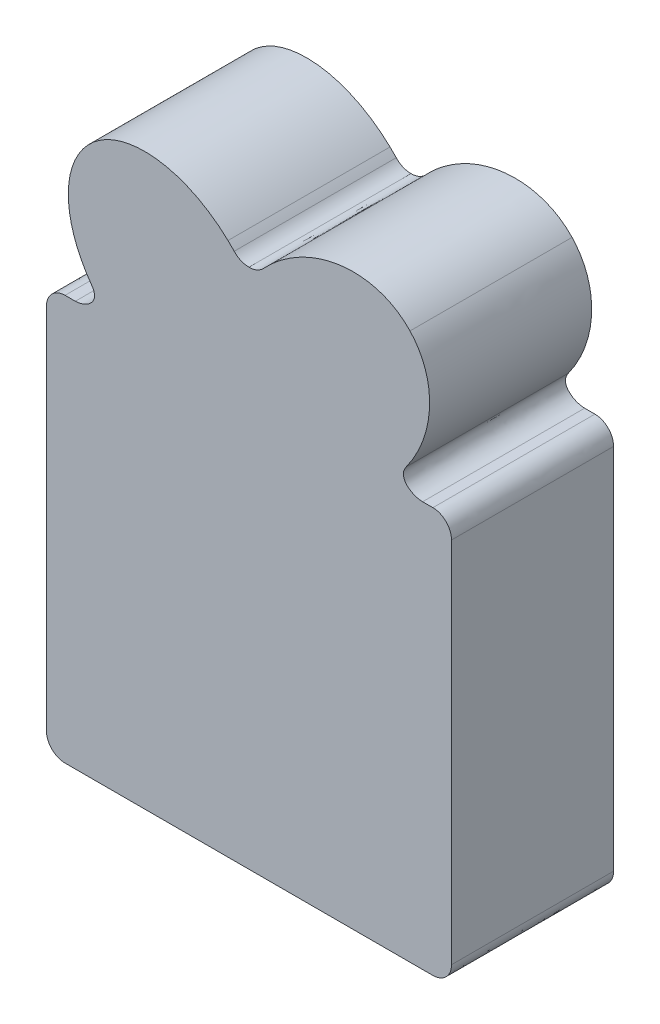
ISO-10303-21;
HEADER;
FILE_DESCRIPTION(('STEP AP214'),'2;1');
FILE_NAME('part.step','',(''),(''),'','','');
FILE_SCHEMA(('AUTOMOTIVE_DESIGN { 1 0 10303 214 1 1 1 1 }'));
ENDSEC;
DATA;
#1=APPLICATION_CONTEXT('core data for automotive mechanical design processes');
#2=APPLICATION_PROTOCOL_DEFINITION('international standard','automotive_design',2000,#1);
#3=PRODUCT_CONTEXT('',#1,'mechanical');
#4=PRODUCT('Part','Part','',(#3));
#5=PRODUCT_RELATED_PRODUCT_CATEGORY('part','',(#4));
#6=PRODUCT_DEFINITION_FORMATION('','',#4);
#7=PRODUCT_DEFINITION_CONTEXT('part definition',#1,'design');
#8=PRODUCT_DEFINITION('design','',#6,#7);
#9=PRODUCT_DEFINITION_SHAPE('','',#8);
#10=(LENGTH_UNIT() NAMED_UNIT(*) SI_UNIT(.MILLI.,.METRE.));
#11=(NAMED_UNIT(*) PLANE_ANGLE_UNIT() SI_UNIT($,.RADIAN.));
#12=(NAMED_UNIT(*) SI_UNIT($,.STERADIAN.) SOLID_ANGLE_UNIT());
#13=UNCERTAINTY_MEASURE_WITH_UNIT(LENGTH_MEASURE(1.E-05),#10,'distance_accuracy_value','');
#14=(GEOMETRIC_REPRESENTATION_CONTEXT(3) GLOBAL_UNCERTAINTY_ASSIGNED_CONTEXT((#13)) GLOBAL_UNIT_ASSIGNED_CONTEXT((#10,
#11,#12)) REPRESENTATION_CONTEXT('',''));
#15=CARTESIAN_POINT('',(0.,0.,0.));
#16=DIRECTION('',(0.,0.,1.));
#17=DIRECTION('',(1.,0.,0.));
#18=AXIS2_PLACEMENT_3D('',#15,#16,#17);
#19=CARTESIAN_POINT('',(497.8514,291.1161998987,8.));
#20=CARTESIAN_POINT('',(497.85140004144,290.60969995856,8.));
#21=CARTESIAN_POINT('',(498.2658,290.1953,8.));
#22=CARTESIAN_POINT('',(498.7723,290.1953,8.));
#23=B_SPLINE_CURVE_WITH_KNOTS('',3,(#19,#20,#21,#22),.UNSPECIFIED.,.F.,.F.,(4,4),(0.90000001,
1.),.UNSPECIFIED.);
#24=DIRECTION('',(0.,0.,-1.));
#25=VECTOR('',#24,1.);
#26=SURFACE_OF_LINEAR_EXTRUSION('',#23,#25);
#27=CARTESIAN_POINT('',(497.8514,291.1161998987,0.));
#28=CARTESIAN_POINT('',(497.85140004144,290.60969995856,0.));
#29=CARTESIAN_POINT('',(498.2658,290.1953,0.));
#30=CARTESIAN_POINT('',(498.7723,290.1953,0.));
#31=B_SPLINE_CURVE_WITH_KNOTS('',3,(#27,#28,#29,#30),.UNSPECIFIED.,.F.,.F.,(4,4),(0.90000001,
1.),.UNSPECIFIED.);
#32=CARTESIAN_POINT('',(497.8514,291.1161998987,0.));
#33=VERTEX_POINT('',#32);
#34=CARTESIAN_POINT('',(498.7723,290.1953,0.));
#35=VERTEX_POINT('',#34);
#36=EDGE_CURVE('E433',#33,#35,#31,.T.);
#37=ORIENTED_EDGE('',*,*,#36,.T.);
#38=DIRECTION('',(0.,0.,-1.));
#39=VECTOR('',#38,1.);
#40=CARTESIAN_POINT('',(498.7723,290.1953,8.));
#41=LINE('',#40,#39);
#42=CARTESIAN_POINT('',(498.7723,290.1953,8.));
#43=VERTEX_POINT('',#42);
#44=EDGE_CURVE('E11',#43,#35,#41,.T.);
#45=ORIENTED_EDGE('',*,*,#44,.F.);
#46=CARTESIAN_POINT('',(497.8514,291.1161998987,8.));
#47=VERTEX_POINT('',#46);
#48=EDGE_CURVE('E357',#47,#43,#23,.T.);
#49=ORIENTED_EDGE('',*,*,#48,.F.);
#50=DIRECTION('',(0.,0.,-1.));
#51=VECTOR('',#50,1.);
#52=CARTESIAN_POINT('',(497.8514,291.1161998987,8.));
#53=LINE('',#52,#51);
#54=EDGE_CURVE('E194',#47,#33,#53,.T.);
#55=ORIENTED_EDGE('',*,*,#54,.T.);
#56=EDGE_LOOP('',(#37,#45,#49,#55));
#57=FACE_BOUND('',#56,.T.);
#58=ADVANCED_FACE('F35',(#57),#26,.F.);
#59=CARTESIAN_POINT('',(498.7723,290.1953,8.));
#60=DIRECTION('',(-8.20224476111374E-08,0.999999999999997,0.));
#61=DIRECTION('',(-0.999999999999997,-8.20224476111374E-08,0.));
#62=AXIS2_PLACEMENT_3D('',#59,#60,#61);
#63=PLANE('',#62);
#64=DIRECTION('',(0.999999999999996,8.20224476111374E-08,0.));
#65=VECTOR('',#64,1.);
#66=CARTESIAN_POINT('',(498.7723,290.1953,0.));
#67=LINE('',#66,#65);
#68=CARTESIAN_POINT('',(516.930500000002,290.19530148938,0.));
#69=VERTEX_POINT('',#68);
#70=EDGE_CURVE('E427',#35,#69,#67,.T.);
#71=ORIENTED_EDGE('',*,*,#70,.T.);
#72=DIRECTION('',(0.,0.,-1.));
#73=VECTOR('',#72,1.);
#74=CARTESIAN_POINT('',(516.930500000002,290.19530148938,8.));
#75=LINE('',#74,#73);
#76=CARTESIAN_POINT('',(516.930500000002,290.19530148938,8.));
#77=VERTEX_POINT('',#76);
#78=EDGE_CURVE('E44',#77,#69,#75,.T.);
#79=ORIENTED_EDGE('',*,*,#78,.F.);
#80=DIRECTION('',(0.999999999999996,8.20224476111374E-08,0.));
#81=VECTOR('',#80,1.);
#82=CARTESIAN_POINT('',(498.7723,290.1953,8.));
#83=LINE('',#82,#81);
#84=EDGE_CURVE('E128',#43,#77,#83,.T.);
#85=ORIENTED_EDGE('',*,*,#84,.F.);
#86=ORIENTED_EDGE('',*,*,#44,.T.);
#87=EDGE_LOOP('',(#71,#79,#85,#86));
#88=FACE_BOUND('',#87,.T.);
#89=ADVANCED_FACE('F347',(#88),#63,.F.);
#90=CARTESIAN_POINT('',(516.930500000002,290.19530148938,8.));
#91=CARTESIAN_POINT('',(517.436999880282,290.19530157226,8.));
#92=CARTESIAN_POINT('',(517.851399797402,290.60970148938,8.));
#93=CARTESIAN_POINT('',(517.851399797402,291.11620148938,8.));
#94=B_SPLINE_CURVE_WITH_KNOTS('',3,(#90,#91,#92,#93),.UNSPECIFIED.,.F.,.F.,(4,4),(0.05000001,
0.1),.UNSPECIFIED.);
#95=DIRECTION('',(0.,0.,-1.));
#96=VECTOR('',#95,1.);
#97=SURFACE_OF_LINEAR_EXTRUSION('',#94,#96);
#98=CARTESIAN_POINT('',(516.930500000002,290.19530148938,0.));
#99=CARTESIAN_POINT('',(517.436999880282,290.19530157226,0.));
#100=CARTESIAN_POINT('',(517.851399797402,290.60970148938,0.));
#101=CARTESIAN_POINT('',(517.851399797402,291.11620148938,0.));
#102=B_SPLINE_CURVE_WITH_KNOTS('',3,(#98,#99,#100,#101),.UNSPECIFIED.,.F.,.F.,(4,4),(0.05000001,
0.1),.UNSPECIFIED.);
#103=CARTESIAN_POINT('',(517.851399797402,291.11620148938,0.));
#104=VERTEX_POINT('',#103);
#105=EDGE_CURVE('E422',#69,#104,#102,.T.);
#106=ORIENTED_EDGE('',*,*,#105,.T.);
#107=DIRECTION('',(0.,0.,-1.));
#108=VECTOR('',#107,1.);
#109=CARTESIAN_POINT('',(517.851399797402,291.11620148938,8.));
#110=LINE('',#109,#108);
#111=CARTESIAN_POINT('',(517.851399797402,291.11620148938,8.));
#112=VERTEX_POINT('',#111);
#113=EDGE_CURVE('E416',#112,#104,#110,.T.);
#114=ORIENTED_EDGE('',*,*,#113,.F.);
#115=EDGE_CURVE('E349',#77,#112,#94,.T.);
#116=ORIENTED_EDGE('',*,*,#115,.F.);
#117=ORIENTED_EDGE('',*,*,#78,.T.);
#118=EDGE_LOOP('',(#106,#114,#116,#117));
#119=FACE_BOUND('',#118,.T.);
#120=ADVANCED_FACE('F344',(#119),#97,.F.);
#121=CARTESIAN_POINT('',(517.851399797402,291.11620148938,8.));
#122=DIRECTION('',(-1.,0.,0.));
#123=DIRECTION('',(0.,0.,1.));
#124=AXIS2_PLACEMENT_3D('',#121,#122,#123);
#125=PLANE('',#124);
#126=CARTESIAN_POINT('',(517.851399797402,291.11620148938,0.));
#127=CARTESIAN_POINT('',(517.851399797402,291.116205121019,0.));
#128=CARTESIAN_POINT('',(517.851399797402,309.274401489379,0.));
#129=B_SPLINE_CURVE_WITH_KNOTS('',2,(#126,#127,#128),.UNSPECIFIED.,.F.,.F.,(3,3),(0.10000001,
0.15),.UNSPECIFIED.);
#130=CARTESIAN_POINT('',(517.851399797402,309.274401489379,0.));
#131=VERTEX_POINT('',#130);
#132=EDGE_CURVE('E429',#104,#131,#129,.T.);
#133=ORIENTED_EDGE('',*,*,#132,.T.);
#134=DIRECTION('',(0.,0.,-1.));
#135=VECTOR('',#134,1.);
#136=CARTESIAN_POINT('',(517.851399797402,309.274401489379,8.));
#137=LINE('',#136,#135);
#138=CARTESIAN_POINT('',(517.851399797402,309.274401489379,8.));
#139=VERTEX_POINT('',#138);
#140=EDGE_CURVE('E413',#139,#131,#137,.T.);
#141=ORIENTED_EDGE('',*,*,#140,.F.);
#142=CARTESIAN_POINT('',(517.851399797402,291.11620148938,8.));
#143=CARTESIAN_POINT('',(517.851399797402,291.116205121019,8.));
#144=CARTESIAN_POINT('',(517.851399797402,309.274401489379,8.));
#145=B_SPLINE_CURVE_WITH_KNOTS('',2,(#142,#143,#144),.UNSPECIFIED.,.F.,.F.,(3,3),(0.10000001,
0.15),.UNSPECIFIED.);
#146=EDGE_CURVE('E328',#112,#139,#145,.T.);
#147=ORIENTED_EDGE('',*,*,#146,.F.);
#148=ORIENTED_EDGE('',*,*,#113,.T.);
#149=EDGE_LOOP('',(#133,#141,#147,#148));
#150=FACE_BOUND('',#149,.T.);
#151=ADVANCED_FACE('F340',(#150),#125,.F.);
#152=CARTESIAN_POINT('',(517.851399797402,309.274401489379,8.));
#153=CARTESIAN_POINT('',(517.851399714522,309.780901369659,8.));
#154=CARTESIAN_POINT('',(517.436999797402,310.195301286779,8.));
#155=CARTESIAN_POINT('',(516.930499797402,310.195301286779,8.));
#156=B_SPLINE_CURVE_WITH_KNOTS('',3,(#152,#153,#154,#155),.UNSPECIFIED.,.F.,.F.,(4,4),
(0.15000001,0.2),.UNSPECIFIED.);
#157=DIRECTION('',(0.,0.,-1.));
#158=VECTOR('',#157,1.);
#159=SURFACE_OF_LINEAR_EXTRUSION('',#156,#158);
#160=CARTESIAN_POINT('',(517.851399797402,309.274401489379,0.));
#161=CARTESIAN_POINT('',(517.851399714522,309.780901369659,0.));
#162=CARTESIAN_POINT('',(517.436999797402,310.195301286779,0.));
#163=CARTESIAN_POINT('',(516.930499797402,310.195301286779,0.));
#164=B_SPLINE_CURVE_WITH_KNOTS('',3,(#160,#161,#162,#163),.UNSPECIFIED.,.F.,.F.,(4,4),
(0.15000001,0.2),.UNSPECIFIED.);
#165=CARTESIAN_POINT('',(516.930499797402,310.195301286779,0.));
#166=VERTEX_POINT('',#165);
#167=EDGE_CURVE('E431',#131,#166,#164,.T.);
#168=ORIENTED_EDGE('',*,*,#167,.T.);
#169=DIRECTION('',(0.,0.,-1.));
#170=VECTOR('',#169,1.);
#171=CARTESIAN_POINT('',(516.930499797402,310.195301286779,8.));
#172=LINE('',#171,#170);
#173=CARTESIAN_POINT('',(516.930499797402,310.195301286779,8.));
#174=VERTEX_POINT('',#173);
#175=EDGE_CURVE('E410',#174,#166,#172,.T.);
#176=ORIENTED_EDGE('',*,*,#175,.F.);
#177=EDGE_CURVE('E323',#139,#174,#156,.T.);
#178=ORIENTED_EDGE('',*,*,#177,.F.);
#179=ORIENTED_EDGE('',*,*,#140,.T.);
#180=EDGE_LOOP('',(#168,#176,#178,#179));
#181=FACE_BOUND('',#180,.T.);
#182=ADVANCED_FACE('F336',(#181),#159,.F.);
#183=CARTESIAN_POINT('',(516.4231981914,310.195301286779,8.));
#184=DIRECTION('',(0.,-1.,0.));
#185=DIRECTION('',(0.,0.,-1.));
#186=AXIS2_PLACEMENT_3D('',#183,#184,#185);
#187=PLANE('',#186);
#188=DIRECTION('',(-1.,0.,0.));
#189=VECTOR('',#188,1.);
#190=CARTESIAN_POINT('',(516.4231981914,310.195301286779,0.));
#191=LINE('',#190,#189);
#192=CARTESIAN_POINT('',(516.4231981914,310.195301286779,0.));
#193=VERTEX_POINT('',#192);
#194=EDGE_CURVE('E449',#166,#193,#191,.T.);
#195=ORIENTED_EDGE('',*,*,#194,.T.);
#196=DIRECTION('',(0.,0.,-1.));
#197=VECTOR('',#196,1.);
#198=CARTESIAN_POINT('',(516.4231981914,310.195301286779,8.));
#199=LINE('',#198,#197);
#200=CARTESIAN_POINT('',(516.4231981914,310.195301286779,8.));
#201=VERTEX_POINT('',#200);
#202=EDGE_CURVE('E407',#201,#193,#199,.T.);
#203=ORIENTED_EDGE('',*,*,#202,.F.);
#204=DIRECTION('',(-1.,0.,0.));
#205=VECTOR('',#204,1.);
#206=CARTESIAN_POINT('',(516.4231981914,310.195301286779,8.));
#207=LINE('',#206,#205);
#208=EDGE_CURVE('E318',#174,#201,#207,.T.);
#209=ORIENTED_EDGE('',*,*,#208,.F.);
#210=ORIENTED_EDGE('',*,*,#175,.T.);
#211=EDGE_LOOP('',(#195,#203,#209,#210));
#212=FACE_BOUND('',#211,.T.);
#213=ADVANCED_FACE('F339',(#212),#187,.F.);
#214=CARTESIAN_POINT('',(516.4231981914,310.195301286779,8.));
#215=CARTESIAN_POINT('',(515.90459825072,310.195301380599,8.));
#216=CARTESIAN_POINT('',(515.16399839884,310.664401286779,8.));
#217=CARTESIAN_POINT('',(515.61469839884,311.283701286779,8.));
#218=B_SPLINE_CURVE_WITH_KNOTS('',3,(#214,#215,#216,#217),.UNSPECIFIED.,.F.,.F.,(4,4),
(0.25000001,0.3),.UNSPECIFIED.);
#219=DIRECTION('',(0.,0.,-1.));
#220=VECTOR('',#219,1.);
#221=SURFACE_OF_LINEAR_EXTRUSION('',#218,#220);
#222=CARTESIAN_POINT('',(516.4231981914,310.195301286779,0.));
#223=CARTESIAN_POINT('',(515.90459825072,310.195301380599,0.));
#224=CARTESIAN_POINT('',(515.16399839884,310.664401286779,0.));
#225=CARTESIAN_POINT('',(515.61469839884,311.283701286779,0.));
#226=B_SPLINE_CURVE_WITH_KNOTS('',3,(#222,#223,#224,#225),.UNSPECIFIED.,.F.,.F.,(4,4),
(0.25000001,0.3),.UNSPECIFIED.);
#227=CARTESIAN_POINT('',(515.61469839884,311.283701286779,0.));
#228=VERTEX_POINT('',#227);
#229=EDGE_CURVE('E454',#193,#228,#226,.T.);
#230=ORIENTED_EDGE('',*,*,#229,.T.);
#231=DIRECTION('',(0.,0.,-1.));
#232=VECTOR('',#231,1.);
#233=CARTESIAN_POINT('',(515.61469839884,311.283701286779,8.));
#234=LINE('',#233,#232);
#235=CARTESIAN_POINT('',(515.61469839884,311.283701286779,8.));
#236=VERTEX_POINT('',#235);
#237=EDGE_CURVE('E404',#236,#228,#234,.T.);
#238=ORIENTED_EDGE('',*,*,#237,.F.);
#239=EDGE_CURVE('E310',#201,#236,#218,.T.);
#240=ORIENTED_EDGE('',*,*,#239,.F.);
#241=ORIENTED_EDGE('',*,*,#202,.T.);
#242=EDGE_LOOP('',(#230,#238,#240,#241));
#243=FACE_BOUND('',#242,.T.);
#244=ADVANCED_FACE('F302',(#243),#221,.F.);
#245=CARTESIAN_POINT('',(515.61469839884,311.283701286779,8.));
#246=CARTESIAN_POINT('',(517.05139785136,313.258000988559,8.));
#247=CARTESIAN_POINT('',(517.18739782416,315.715500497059,8.));
#248=CARTESIAN_POINT('',(515.80099782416,317.186700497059,8.));
#249=B_SPLINE_CURVE_WITH_KNOTS('',3,(#245,#246,#247,#248),.UNSPECIFIED.,.F.,.F.,(4,4),
(0.30000001,0.35),.UNSPECIFIED.);
#250=DIRECTION('',(0.,0.,-1.));
#251=VECTOR('',#250,1.);
#252=SURFACE_OF_LINEAR_EXTRUSION('',#249,#251);
#253=CARTESIAN_POINT('',(515.61469839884,311.283701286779,0.));
#254=CARTESIAN_POINT('',(517.05139785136,313.258000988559,0.));
#255=CARTESIAN_POINT('',(517.18739782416,315.715500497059,0.));
#256=CARTESIAN_POINT('',(515.80099782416,317.186700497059,0.));
#257=B_SPLINE_CURVE_WITH_KNOTS('',3,(#253,#254,#255,#256),.UNSPECIFIED.,.F.,.F.,(4,4),
(0.30000001,0.35),.UNSPECIFIED.);
#258=CARTESIAN_POINT('',(515.80099782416,317.186700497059,0.));
#259=VERTEX_POINT('',#258);
#260=EDGE_CURVE('E458',#228,#259,#257,.T.);
#261=ORIENTED_EDGE('',*,*,#260,.T.);
#262=DIRECTION('',(0.,0.,-1.));
#263=VECTOR('',#262,1.);
#264=CARTESIAN_POINT('',(515.80099782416,317.186700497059,8.));
#265=LINE('',#264,#263);
#266=CARTESIAN_POINT('',(515.80099782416,317.186700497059,8.));
#267=VERTEX_POINT('',#266);
#268=EDGE_CURVE('E401',#267,#259,#265,.T.);
#269=ORIENTED_EDGE('',*,*,#268,.F.);
#270=EDGE_CURVE('E306',#236,#267,#249,.T.);
#271=ORIENTED_EDGE('',*,*,#270,.F.);
#272=ORIENTED_EDGE('',*,*,#237,.T.);
#273=EDGE_LOOP('',(#261,#269,#271,#272));
#274=FACE_BOUND('',#273,.T.);
#275=ADVANCED_FACE('F298',(#274),#252,.F.);
#276=CARTESIAN_POINT('',(515.80099782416,317.186700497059,8.));
#277=CARTESIAN_POINT('',(514.1777978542,318.909199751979,8.));
#278=CARTESIAN_POINT('',(511.08159847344,318.628799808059,8.));
#279=CARTESIAN_POINT('',(508.88659847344,316.560299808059,8.));
#280=B_SPLINE_CURVE_WITH_KNOTS('',3,(#276,#277,#278,#279),.UNSPECIFIED.,.F.,.F.,(4,4),
(0.35000001,0.4),.UNSPECIFIED.);
#281=DIRECTION('',(0.,0.,-1.));
#282=VECTOR('',#281,1.);
#283=SURFACE_OF_LINEAR_EXTRUSION('',#280,#282);
#284=CARTESIAN_POINT('',(515.80099782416,317.186700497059,0.));
#285=CARTESIAN_POINT('',(514.1777978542,318.909199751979,0.));
#286=CARTESIAN_POINT('',(511.08159847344,318.628799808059,0.));
#287=CARTESIAN_POINT('',(508.88659847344,316.560299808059,0.));
#288=B_SPLINE_CURVE_WITH_KNOTS('',3,(#284,#285,#286,#287),.UNSPECIFIED.,.F.,.F.,(4,4),
(0.35000001,0.4),.UNSPECIFIED.);
#289=CARTESIAN_POINT('',(508.88659847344,316.560299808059,0.));
#290=VERTEX_POINT('',#289);
#291=EDGE_CURVE('E465',#259,#290,#288,.T.);
#292=ORIENTED_EDGE('',*,*,#291,.T.);
#293=DIRECTION('',(0.,0.,-1.));
#294=VECTOR('',#293,1.);
#295=CARTESIAN_POINT('',(508.88659847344,316.560299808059,8.));
#296=LINE('',#295,#294);
#297=CARTESIAN_POINT('',(508.88659847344,316.560299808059,8.));
#298=VERTEX_POINT('',#297);
#299=EDGE_CURVE('E398',#298,#290,#296,.T.);
#300=ORIENTED_EDGE('',*,*,#299,.F.);
#301=EDGE_CURVE('E283',#267,#298,#280,.T.);
#302=ORIENTED_EDGE('',*,*,#301,.F.);
#303=ORIENTED_EDGE('',*,*,#268,.T.);
#304=EDGE_LOOP('',(#292,#300,#302,#303));
#305=FACE_BOUND('',#304,.T.);
#306=ADVANCED_FACE('F294',(#305),#283,.F.);
#307=CARTESIAN_POINT('',(508.88659847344,316.560299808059,8.));
#308=CARTESIAN_POINT('',(508.7808984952,316.460599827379,8.));
#309=CARTESIAN_POINT('',(508.67829851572,316.357799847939,8.));
#310=CARTESIAN_POINT('',(508.58069851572,316.253799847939,8.));
#311=B_SPLINE_CURVE_WITH_KNOTS('',3,(#307,#308,#309,#310),.UNSPECIFIED.,.F.,.F.,(4,4),
(0.40000001,0.45),.UNSPECIFIED.);
#312=DIRECTION('',(0.,0.,-1.));
#313=VECTOR('',#312,1.);
#314=SURFACE_OF_LINEAR_EXTRUSION('',#311,#313);
#315=CARTESIAN_POINT('',(508.88659847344,316.560299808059,0.));
#316=CARTESIAN_POINT('',(508.7808984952,316.460599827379,0.));
#317=CARTESIAN_POINT('',(508.67829851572,316.357799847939,0.));
#318=CARTESIAN_POINT('',(508.58069851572,316.253799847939,0.));
#319=B_SPLINE_CURVE_WITH_KNOTS('',3,(#315,#316,#317,#318),.UNSPECIFIED.,.F.,.F.,(4,4),
(0.40000001,0.45),.UNSPECIFIED.);
#320=CARTESIAN_POINT('',(508.58069851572,316.253799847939,0.));
#321=VERTEX_POINT('',#320);
#322=EDGE_CURVE('E472',#290,#321,#319,.T.);
#323=ORIENTED_EDGE('',*,*,#322,.T.);
#324=DIRECTION('',(0.,0.,-1.));
#325=VECTOR('',#324,1.);
#326=CARTESIAN_POINT('',(508.58069851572,316.253799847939,8.));
#327=LINE('',#326,#325);
#328=CARTESIAN_POINT('',(508.58069851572,316.253799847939,8.));
#329=VERTEX_POINT('',#328);
#330=EDGE_CURVE('E395',#329,#321,#327,.T.);
#331=ORIENTED_EDGE('',*,*,#330,.F.);
#332=EDGE_CURVE('E275',#298,#329,#311,.T.);
#333=ORIENTED_EDGE('',*,*,#332,.F.);
#334=ORIENTED_EDGE('',*,*,#299,.T.);
#335=EDGE_LOOP('',(#323,#331,#333,#334));
#336=FACE_BOUND('',#335,.T.);
#337=ADVANCED_FACE('F291',(#336),#314,.F.);
#338=CARTESIAN_POINT('',(508.58069851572,316.253799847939,8.));
#339=CARTESIAN_POINT('',(508.38489854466,316.044999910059,8.));
#340=CARTESIAN_POINT('',(508.13799859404,315.937999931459,8.));
#341=CARTESIAN_POINT('',(507.85139859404,315.937999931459,8.));
#342=B_SPLINE_CURVE_WITH_KNOTS('',3,(#338,#339,#340,#341),.UNSPECIFIED.,.F.,.F.,(4,4),
(0.45000001,0.5),.UNSPECIFIED.);
#343=DIRECTION('',(0.,0.,-1.));
#344=VECTOR('',#343,1.);
#345=SURFACE_OF_LINEAR_EXTRUSION('',#342,#344);
#346=CARTESIAN_POINT('',(508.58069851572,316.253799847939,0.));
#347=CARTESIAN_POINT('',(508.38489854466,316.044999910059,0.));
#348=CARTESIAN_POINT('',(508.13799859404,315.937999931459,0.));
#349=CARTESIAN_POINT('',(507.85139859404,315.937999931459,0.));
#350=B_SPLINE_CURVE_WITH_KNOTS('',3,(#346,#347,#348,#349),.UNSPECIFIED.,.F.,.F.,(4,4),
(0.45000001,0.5),.UNSPECIFIED.);
#351=CARTESIAN_POINT('',(507.85139859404,315.937999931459,0.));
#352=VERTEX_POINT('',#351);
#353=EDGE_CURVE('E479',#321,#352,#350,.T.);
#354=ORIENTED_EDGE('',*,*,#353,.T.);
#355=DIRECTION('',(0.,0.,-1.));
#356=VECTOR('',#355,1.);
#357=CARTESIAN_POINT('',(507.85139859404,315.937999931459,8.));
#358=LINE('',#357,#356);
#359=CARTESIAN_POINT('',(507.85139859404,315.937999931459,8.));
#360=VERTEX_POINT('',#359);
#361=EDGE_CURVE('E392',#360,#352,#358,.T.);
#362=ORIENTED_EDGE('',*,*,#361,.F.);
#363=EDGE_CURVE('E267',#329,#360,#342,.T.);
#364=ORIENTED_EDGE('',*,*,#363,.F.);
#365=ORIENTED_EDGE('',*,*,#330,.T.);
#366=EDGE_LOOP('',(#354,#362,#364,#365));
#367=FACE_BOUND('',#366,.T.);
#368=ADVANCED_FACE('F259',(#367),#345,.F.);
#369=CARTESIAN_POINT('',(507.85139859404,315.937999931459,8.));
#370=CARTESIAN_POINT('',(507.5647986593,315.937999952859,8.));
#371=CARTESIAN_POINT('',(507.31789870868,316.044999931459,8.));
#372=CARTESIAN_POINT('',(507.12209870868,316.253799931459,8.));
#373=B_SPLINE_CURVE_WITH_KNOTS('',3,(#369,#370,#371,#372),.UNSPECIFIED.,.F.,.F.,(4,4),
(0.50000001,0.55),.UNSPECIFIED.);
#374=DIRECTION('',(0.,0.,-1.));
#375=VECTOR('',#374,1.);
#376=SURFACE_OF_LINEAR_EXTRUSION('',#373,#375);
#377=CARTESIAN_POINT('',(507.85139859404,315.937999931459,0.));
#378=CARTESIAN_POINT('',(507.5647986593,315.937999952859,0.));
#379=CARTESIAN_POINT('',(507.31789870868,316.044999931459,0.));
#380=CARTESIAN_POINT('',(507.12209870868,316.253799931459,0.));
#381=B_SPLINE_CURVE_WITH_KNOTS('',3,(#377,#378,#379,#380),.UNSPECIFIED.,.F.,.F.,(4,4),
(0.50000001,0.55),.UNSPECIFIED.);
#382=CARTESIAN_POINT('',(507.12209870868,316.253799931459,0.));
#383=VERTEX_POINT('',#382);
#384=EDGE_CURVE('E486',#352,#383,#381,.T.);
#385=ORIENTED_EDGE('',*,*,#384,.T.);
#386=DIRECTION('',(0.,0.,-1.));
#387=VECTOR('',#386,1.);
#388=CARTESIAN_POINT('',(507.12209870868,316.253799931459,8.));
#389=LINE('',#388,#387);
#390=CARTESIAN_POINT('',(507.12209870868,316.253799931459,8.));
#391=VERTEX_POINT('',#390);
#392=EDGE_CURVE('E389',#391,#383,#389,.T.);
#393=ORIENTED_EDGE('',*,*,#392,.F.);
#394=EDGE_CURVE('E263',#360,#391,#373,.T.);
#395=ORIENTED_EDGE('',*,*,#394,.F.);
#396=ORIENTED_EDGE('',*,*,#361,.T.);
#397=EDGE_LOOP('',(#385,#393,#395,#396));
#398=FACE_BOUND('',#397,.T.);
#399=ADVANCED_FACE('F255',(#398),#376,.F.);
#400=CARTESIAN_POINT('',(507.12209870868,316.253799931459,8.));
#401=CARTESIAN_POINT('',(507.0244987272,316.357799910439,8.));
#402=CARTESIAN_POINT('',(506.92189874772,316.460699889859,8.));
#403=CARTESIAN_POINT('',(506.81619874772,316.560299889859,8.));
#404=B_SPLINE_CURVE_WITH_KNOTS('',3,(#400,#401,#402,#403),.UNSPECIFIED.,.F.,.F.,(4,4),
(0.55000001,0.6),.UNSPECIFIED.);
#405=DIRECTION('',(0.,0.,-1.));
#406=VECTOR('',#405,1.);
#407=SURFACE_OF_LINEAR_EXTRUSION('',#404,#406);
#408=CARTESIAN_POINT('',(507.12209870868,316.253799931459,0.));
#409=CARTESIAN_POINT('',(507.0244987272,316.357799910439,0.));
#410=CARTESIAN_POINT('',(506.92189874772,316.460699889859,0.));
#411=CARTESIAN_POINT('',(506.81619874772,316.560299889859,0.));
#412=B_SPLINE_CURVE_WITH_KNOTS('',3,(#408,#409,#410,#411),.UNSPECIFIED.,.F.,.F.,(4,4),
(0.55000001,0.6),.UNSPECIFIED.);
#413=CARTESIAN_POINT('',(506.81619874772,316.560299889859,0.));
#414=VERTEX_POINT('',#413);
#415=EDGE_CURVE('E493',#383,#414,#412,.T.);
#416=ORIENTED_EDGE('',*,*,#415,.T.);
#417=DIRECTION('',(0.,0.,-1.));
#418=VECTOR('',#417,1.);
#419=CARTESIAN_POINT('',(506.81619874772,316.560299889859,8.));
#420=LINE('',#419,#418);
#421=CARTESIAN_POINT('',(506.81619874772,316.560299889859,8.));
#422=VERTEX_POINT('',#421);
#423=EDGE_CURVE('E386',#422,#414,#420,.T.);
#424=ORIENTED_EDGE('',*,*,#423,.F.);
#425=EDGE_CURVE('E240',#391,#422,#404,.T.);
#426=ORIENTED_EDGE('',*,*,#425,.F.);
#427=ORIENTED_EDGE('',*,*,#392,.T.);
#428=EDGE_LOOP('',(#416,#424,#426,#427));
#429=FACE_BOUND('',#428,.T.);
#430=ADVANCED_FACE('F251',(#429),#407,.F.);
#431=CARTESIAN_POINT('',(506.81619874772,316.560299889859,8.));
#432=CARTESIAN_POINT('',(504.62129900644,318.628799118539,8.));
#433=CARTESIAN_POINT('',(501.52509962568,318.909199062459,8.));
#434=CARTESIAN_POINT('',(499.90179962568,317.186699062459,8.));
#435=B_SPLINE_CURVE_WITH_KNOTS('',3,(#431,#432,#433,#434),.UNSPECIFIED.,.F.,.F.,(4,4),
(0.60000001,0.65),.UNSPECIFIED.);
#436=DIRECTION('',(0.,0.,-1.));
#437=VECTOR('',#436,1.);
#438=SURFACE_OF_LINEAR_EXTRUSION('',#435,#437);
#439=CARTESIAN_POINT('',(506.81619874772,316.560299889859,0.));
#440=CARTESIAN_POINT('',(504.62129900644,318.628799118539,0.));
#441=CARTESIAN_POINT('',(501.52509962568,318.909199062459,0.));
#442=CARTESIAN_POINT('',(499.90179962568,317.186699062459,0.));
#443=B_SPLINE_CURVE_WITH_KNOTS('',3,(#439,#440,#441,#442),.UNSPECIFIED.,.F.,.F.,(4,4),
(0.60000001,0.65),.UNSPECIFIED.);
#444=CARTESIAN_POINT('',(499.90179962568,317.186699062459,0.));
#445=VERTEX_POINT('',#444);
#446=EDGE_CURVE('E500',#414,#445,#443,.T.);
#447=ORIENTED_EDGE('',*,*,#446,.T.);
#448=DIRECTION('',(0.,0.,-1.));
#449=VECTOR('',#448,1.);
#450=CARTESIAN_POINT('',(499.90179962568,317.186699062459,8.));
#451=LINE('',#450,#449);
#452=CARTESIAN_POINT('',(499.90179962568,317.186699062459,8.));
#453=VERTEX_POINT('',#452);
#454=EDGE_CURVE('E383',#453,#445,#451,.T.);
#455=ORIENTED_EDGE('',*,*,#454,.F.);
#456=EDGE_CURVE('E232',#422,#453,#435,.T.);
#457=ORIENTED_EDGE('',*,*,#456,.F.);
#458=ORIENTED_EDGE('',*,*,#423,.T.);
#459=EDGE_LOOP('',(#447,#455,#457,#458));
#460=FACE_BOUND('',#459,.T.);
#461=ADVANCED_FACE('F248',(#460),#438,.F.);
#462=CARTESIAN_POINT('',(499.90179962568,317.186699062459,8.));
#463=CARTESIAN_POINT('',(498.51540020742,315.715399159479,8.));
#464=CARTESIAN_POINT('',(498.65130018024,313.257899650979,8.));
#465=CARTESIAN_POINT('',(500.08810018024,311.283699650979,8.));
#466=B_SPLINE_CURVE_WITH_KNOTS('',3,(#462,#463,#464,#465),.UNSPECIFIED.,.F.,.F.,(4,4),
(0.65000001,0.7),.UNSPECIFIED.);
#467=DIRECTION('',(0.,0.,-1.));
#468=VECTOR('',#467,1.);
#469=SURFACE_OF_LINEAR_EXTRUSION('',#466,#468);
#470=CARTESIAN_POINT('',(499.90179962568,317.186699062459,0.));
#471=CARTESIAN_POINT('',(498.51540020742,315.715399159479,0.));
#472=CARTESIAN_POINT('',(498.65130018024,313.257899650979,0.));
#473=CARTESIAN_POINT('',(500.08810018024,311.283699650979,0.));
#474=B_SPLINE_CURVE_WITH_KNOTS('',3,(#470,#471,#472,#473),.UNSPECIFIED.,.F.,.F.,(4,4),
(0.65000001,0.7),.UNSPECIFIED.);
#475=CARTESIAN_POINT('',(500.08810018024,311.283699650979,0.));
#476=VERTEX_POINT('',#475);
#477=EDGE_CURVE('E507',#445,#476,#474,.T.);
#478=ORIENTED_EDGE('',*,*,#477,.T.);
#479=DIRECTION('',(0.,0.,-1.));
#480=VECTOR('',#479,1.);
#481=CARTESIAN_POINT('',(500.08810018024,311.283699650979,8.));
#482=LINE('',#481,#480);
#483=CARTESIAN_POINT('',(500.08810018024,311.283699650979,8.));
#484=VERTEX_POINT('',#483);
#485=EDGE_CURVE('E380',#484,#476,#482,.T.);
#486=ORIENTED_EDGE('',*,*,#485,.F.);
#487=EDGE_CURVE('E224',#453,#484,#466,.T.);
#488=ORIENTED_EDGE('',*,*,#487,.F.);
#489=ORIENTED_EDGE('',*,*,#454,.T.);
#490=EDGE_LOOP('',(#478,#486,#488,#489));
#491=FACE_BOUND('',#490,.T.);
#492=ADVANCED_FACE('F217',(#491),#469,.F.);
#493=CARTESIAN_POINT('',(500.08810018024,311.283699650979,8.));
#494=CARTESIAN_POINT('',(500.53869985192,310.664399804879,8.));
#495=CARTESIAN_POINT('',(499.7983,310.195299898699,8.));
#496=CARTESIAN_POINT('',(499.2796,310.195299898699,8.));
#497=B_SPLINE_CURVE_WITH_KNOTS('',3,(#493,#494,#495,#496),.UNSPECIFIED.,.F.,.F.,(4,4),
(0.70000001,0.75),.UNSPECIFIED.);
#498=DIRECTION('',(0.,0.,-1.));
#499=VECTOR('',#498,1.);
#500=SURFACE_OF_LINEAR_EXTRUSION('',#497,#499);
#501=CARTESIAN_POINT('',(500.08810018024,311.283699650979,0.));
#502=CARTESIAN_POINT('',(500.53869985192,310.664399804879,0.));
#503=CARTESIAN_POINT('',(499.7983,310.195299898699,0.));
#504=CARTESIAN_POINT('',(499.2796,310.195299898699,0.));
#505=B_SPLINE_CURVE_WITH_KNOTS('',3,(#501,#502,#503,#504),.UNSPECIFIED.,.F.,.F.,(4,4),
(0.70000001,0.75),.UNSPECIFIED.);
#506=CARTESIAN_POINT('',(499.2796,310.195299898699,0.));
#507=VERTEX_POINT('',#506);
#508=EDGE_CURVE('E514',#476,#507,#505,.T.);
#509=ORIENTED_EDGE('',*,*,#508,.T.);
#510=DIRECTION('',(0.,0.,-1.));
#511=VECTOR('',#510,1.);
#512=CARTESIAN_POINT('',(499.2796,310.195299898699,8.));
#513=LINE('',#512,#511);
#514=CARTESIAN_POINT('',(499.2796,310.195299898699,8.));
#515=VERTEX_POINT('',#514);
#516=EDGE_CURVE('E189',#515,#507,#513,.T.);
#517=ORIENTED_EDGE('',*,*,#516,.F.);
#518=EDGE_CURVE('E180',#484,#515,#497,.T.);
#519=ORIENTED_EDGE('',*,*,#518,.F.);
#520=ORIENTED_EDGE('',*,*,#485,.T.);
#521=EDGE_LOOP('',(#509,#517,#519,#520));
#522=FACE_BOUND('',#521,.T.);
#523=ADVANCED_FACE('F214',(#522),#500,.F.);
#524=CARTESIAN_POINT('',(498.7722997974,310.195299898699,8.));
#525=DIRECTION('',(0.,-1.,0.));
#526=DIRECTION('',(0.,0.,-1.));
#527=AXIS2_PLACEMENT_3D('',#524,#525,#526);
#528=PLANE('',#527);
#529=DIRECTION('',(-1.,0.,0.));
#530=VECTOR('',#529,1.);
#531=CARTESIAN_POINT('',(498.7722997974,310.195299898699,0.));
#532=LINE('',#531,#530);
#533=CARTESIAN_POINT('',(498.7722997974,310.195299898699,0.));
#534=VERTEX_POINT('',#533);
#535=EDGE_CURVE('E188',#507,#534,#532,.T.);
#536=ORIENTED_EDGE('',*,*,#535,.T.);
#537=DIRECTION('',(0.,0.,-1.));
#538=VECTOR('',#537,1.);
#539=CARTESIAN_POINT('',(498.7722997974,310.195299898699,8.));
#540=LINE('',#539,#538);
#541=CARTESIAN_POINT('',(498.7722997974,310.195299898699,8.));
#542=VERTEX_POINT('',#541);
#543=EDGE_CURVE('E185',#542,#534,#540,.T.);
#544=ORIENTED_EDGE('',*,*,#543,.F.);
#545=DIRECTION('',(-1.,0.,0.));
#546=VECTOR('',#545,1.);
#547=CARTESIAN_POINT('',(498.7722997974,310.195299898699,8.));
#548=LINE('',#547,#546);
#549=EDGE_CURVE('E174',#515,#542,#548,.T.);
#550=ORIENTED_EDGE('',*,*,#549,.F.);
#551=ORIENTED_EDGE('',*,*,#516,.T.);
#552=EDGE_LOOP('',(#536,#544,#550,#551));
#553=FACE_BOUND('',#552,.T.);
#554=ADVANCED_FACE('F186',(#553),#528,.F.);
#555=CARTESIAN_POINT('',(498.7722997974,310.195299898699,8.));
#556=CARTESIAN_POINT('',(498.26579991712,310.195299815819,8.));
#557=CARTESIAN_POINT('',(497.8514,309.780899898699,8.));
#558=CARTESIAN_POINT('',(497.8514,309.274399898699,8.));
#559=B_SPLINE_CURVE_WITH_KNOTS('',3,(#555,#556,#557,#558),.UNSPECIFIED.,.F.,.F.,(4,4),
(0.80000001,0.85),.UNSPECIFIED.);
#560=DIRECTION('',(0.,0.,-1.));
#561=VECTOR('',#560,1.);
#562=SURFACE_OF_LINEAR_EXTRUSION('',#559,#561);
#563=CARTESIAN_POINT('',(498.7722997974,310.195299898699,0.));
#564=CARTESIAN_POINT('',(498.26579991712,310.195299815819,0.));
#565=CARTESIAN_POINT('',(497.8514,309.780899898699,0.));
#566=CARTESIAN_POINT('',(497.8514,309.274399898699,0.));
#567=B_SPLINE_CURVE_WITH_KNOTS('',3,(#563,#564,#565,#566),.UNSPECIFIED.,.F.,.F.,(4,4),
(0.80000001,0.85),.UNSPECIFIED.);
#568=CARTESIAN_POINT('',(497.8514,309.274399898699,0.));
#569=VERTEX_POINT('',#568);
#570=EDGE_CURVE('E114',#534,#569,#567,.T.);
#571=ORIENTED_EDGE('',*,*,#570,.T.);
#572=DIRECTION('',(0.,0.,-1.));
#573=VECTOR('',#572,1.);
#574=CARTESIAN_POINT('',(497.8514,309.274399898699,8.));
#575=LINE('',#574,#573);
#576=CARTESIAN_POINT('',(497.8514,309.274399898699,8.));
#577=VERTEX_POINT('',#576);
#578=EDGE_CURVE('E190',#577,#569,#575,.T.);
#579=ORIENTED_EDGE('',*,*,#578,.F.);
#580=EDGE_CURVE('E178',#542,#577,#559,.T.);
#581=ORIENTED_EDGE('',*,*,#580,.F.);
#582=ORIENTED_EDGE('',*,*,#543,.T.);
#583=EDGE_LOOP('',(#571,#579,#581,#582));
#584=FACE_BOUND('',#583,.T.);
#585=ADVANCED_FACE('F192',(#584),#562,.F.);
#586=CARTESIAN_POINT('',(497.8514,309.274399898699,8.));
#587=DIRECTION('',(1.,0.,0.));
#588=DIRECTION('',(0.,0.,-1.));
#589=AXIS2_PLACEMENT_3D('',#586,#587,#588);
#590=PLANE('',#589);
#591=CARTESIAN_POINT('',(497.8514,309.274399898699,0.));
#592=CARTESIAN_POINT('',(497.8514,309.27439626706,0.));
#593=CARTESIAN_POINT('',(497.8514,291.1161998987,0.));
#594=B_SPLINE_CURVE_WITH_KNOTS('',2,(#591,#592,#593),.UNSPECIFIED.,.F.,.F.,(3,3),(0.85000001,
0.9),.UNSPECIFIED.);
#595=EDGE_CURVE('E120',#569,#33,#594,.T.);
#596=ORIENTED_EDGE('',*,*,#595,.T.);
#597=ORIENTED_EDGE('',*,*,#54,.F.);
#598=CARTESIAN_POINT('',(497.8514,309.274399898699,8.));
#599=CARTESIAN_POINT('',(497.8514,309.27439626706,8.));
#600=CARTESIAN_POINT('',(497.8514,291.1161998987,8.));
#601=B_SPLINE_CURVE_WITH_KNOTS('',2,(#598,#599,#600),.UNSPECIFIED.,.F.,.F.,(3,3),(0.85000001,
0.9),.UNSPECIFIED.);
#602=EDGE_CURVE('E52',#577,#47,#601,.T.);
#603=ORIENTED_EDGE('',*,*,#602,.F.);
#604=ORIENTED_EDGE('',*,*,#578,.T.);
#605=EDGE_LOOP('',(#596,#597,#603,#604));
#606=FACE_BOUND('',#605,.T.);
#607=ADVANCED_FACE('F210',(#606),#590,.F.);
#608=CARTESIAN_POINT('',(498.12191251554,290.465812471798,8.));
#609=DIRECTION('',(0.,0.,-1.));
#610=DIRECTION('',(-1.,0.,0.));
#611=AXIS2_PLACEMENT_3D('',#608,#609,#610);
#612=PLANE('',#611);
#613=ORIENTED_EDGE('',*,*,#48,.T.);
#614=ORIENTED_EDGE('',*,*,#84,.T.);
#615=ORIENTED_EDGE('',*,*,#115,.T.);
#616=ORIENTED_EDGE('',*,*,#146,.T.);
#617=ORIENTED_EDGE('',*,*,#177,.T.);
#618=ORIENTED_EDGE('',*,*,#208,.T.);
#619=ORIENTED_EDGE('',*,*,#239,.T.);
#620=ORIENTED_EDGE('',*,*,#270,.T.);
#621=ORIENTED_EDGE('',*,*,#301,.T.);
#622=ORIENTED_EDGE('',*,*,#332,.T.);
#623=ORIENTED_EDGE('',*,*,#363,.T.);
#624=ORIENTED_EDGE('',*,*,#394,.T.);
#625=ORIENTED_EDGE('',*,*,#425,.T.);
#626=ORIENTED_EDGE('',*,*,#456,.T.);
#627=ORIENTED_EDGE('',*,*,#487,.T.);
#628=ORIENTED_EDGE('',*,*,#518,.T.);
#629=ORIENTED_EDGE('',*,*,#549,.T.);
#630=ORIENTED_EDGE('',*,*,#580,.T.);
#631=ORIENTED_EDGE('',*,*,#602,.T.);
#632=EDGE_LOOP('',(#613,#614,#615,#616,#617,#618,#619,#620,#621,#622,#623,#624,#625,#626,#627,
#628,#629,#630,#631));
#633=FACE_BOUND('',#632,.T.);
#634=ADVANCED_FACE('F176',(#633),#612,.F.);
#635=CARTESIAN_POINT('',(498.12191251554,290.465812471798,0.));
#636=DIRECTION('',(0.,0.,-1.));
#637=DIRECTION('',(-1.,0.,0.));
#638=AXIS2_PLACEMENT_3D('',#635,#636,#637);
#639=PLANE('',#638);
#640=ORIENTED_EDGE('',*,*,#36,.F.);
#641=ORIENTED_EDGE('',*,*,#595,.F.);
#642=ORIENTED_EDGE('',*,*,#570,.F.);
#643=ORIENTED_EDGE('',*,*,#535,.F.);
#644=ORIENTED_EDGE('',*,*,#508,.F.);
#645=ORIENTED_EDGE('',*,*,#477,.F.);
#646=ORIENTED_EDGE('',*,*,#446,.F.);
#647=ORIENTED_EDGE('',*,*,#415,.F.);
#648=ORIENTED_EDGE('',*,*,#384,.F.);
#649=ORIENTED_EDGE('',*,*,#353,.F.);
#650=ORIENTED_EDGE('',*,*,#322,.F.);
#651=ORIENTED_EDGE('',*,*,#291,.F.);
#652=ORIENTED_EDGE('',*,*,#260,.F.);
#653=ORIENTED_EDGE('',*,*,#229,.F.);
#654=ORIENTED_EDGE('',*,*,#194,.F.);
#655=ORIENTED_EDGE('',*,*,#167,.F.);
#656=ORIENTED_EDGE('',*,*,#132,.F.);
#657=ORIENTED_EDGE('',*,*,#105,.F.);
#658=ORIENTED_EDGE('',*,*,#70,.F.);
#659=EDGE_LOOP('',(#640,#641,#642,#643,#644,#645,#646,#647,#648,#649,#650,#651,#652,#653,#654,
#655,#656,#657,#658));
#660=FACE_BOUND('',#659,.T.);
#661=ADVANCED_FACE('F426',(#660),#639,.T.);
#662=CLOSED_SHELL('',(#58,#89,#120,#151,#182,#213,#244,#275,#306,#337,#368,#399,#430,#461,#492,
#523,#554,#585,#607,#634,#661));
#663=MANIFOLD_SOLID_BREP('B2',#662);
#664=ADVANCED_BREP_SHAPE_REPRESENTATION('',(#18,#663),#14);
#665=SHAPE_DEFINITION_REPRESENTATION(#9,#664);
ENDSEC;
END-ISO-10303-21;
